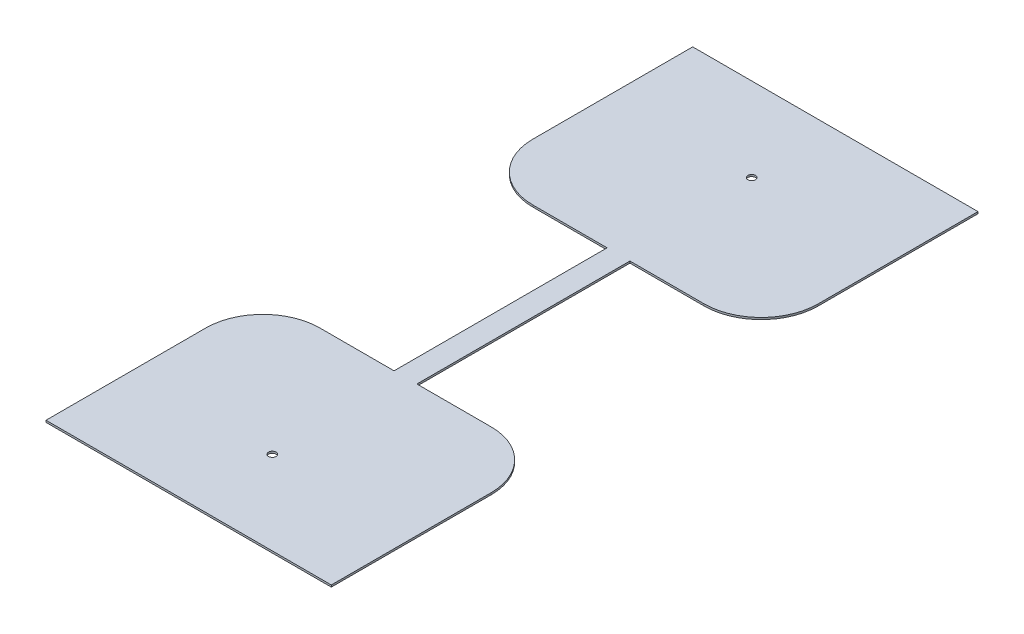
ISO-10303-21;
HEADER;
FILE_DESCRIPTION(('STEP AP214'),'2;1');
FILE_NAME('part.step','',(''),(''),'','','');
FILE_SCHEMA(('AUTOMOTIVE_DESIGN { 1 0 10303 214 1 1 1 1 }'));
ENDSEC;
DATA;
#1=APPLICATION_CONTEXT('core data for automotive mechanical design processes');
#2=APPLICATION_PROTOCOL_DEFINITION('international standard','automotive_design',2000,#1);
#3=PRODUCT_CONTEXT('',#1,'mechanical');
#4=PRODUCT('Part','Part','',(#3));
#5=PRODUCT_RELATED_PRODUCT_CATEGORY('part','',(#4));
#6=PRODUCT_DEFINITION_FORMATION('','',#4);
#7=PRODUCT_DEFINITION_CONTEXT('part definition',#1,'design');
#8=PRODUCT_DEFINITION('design','',#6,#7);
#9=PRODUCT_DEFINITION_SHAPE('','',#8);
#10=(LENGTH_UNIT() NAMED_UNIT(*) SI_UNIT(.MILLI.,.METRE.));
#11=(NAMED_UNIT(*) PLANE_ANGLE_UNIT() SI_UNIT($,.RADIAN.));
#12=(NAMED_UNIT(*) SI_UNIT($,.STERADIAN.) SOLID_ANGLE_UNIT());
#13=UNCERTAINTY_MEASURE_WITH_UNIT(LENGTH_MEASURE(1.E-05),#10,'distance_accuracy_value','');
#14=(GEOMETRIC_REPRESENTATION_CONTEXT(3) GLOBAL_UNCERTAINTY_ASSIGNED_CONTEXT((#13)) GLOBAL_UNIT_ASSIGNED_CONTEXT((#10,
#11,#12)) REPRESENTATION_CONTEXT('',''));
#15=CARTESIAN_POINT('',(0.,0.,0.));
#16=DIRECTION('',(0.,0.,1.));
#17=DIRECTION('',(1.,0.,0.));
#18=AXIS2_PLACEMENT_3D('',#15,#16,#17);
#19=CARTESIAN_POINT('',(-22.5,0.5,-43.));
#20=DIRECTION('',(0.,1.,0.));
#21=DIRECTION('',(0.,0.,1.));
#22=AXIS2_PLACEMENT_3D('',#19,#20,#21);
#23=PLANE('',#22);
#24=CARTESIAN_POINT('',(0.,0.5,63.));
#25=DIRECTION('',(0.,1.,0.));
#26=DIRECTION('',(0.,0.,-1.));
#27=AXIS2_PLACEMENT_3D('',#24,#25,#26);
#28=CIRCLE('',#27,1.);
#29=CARTESIAN_POINT('',(0.,0.5,62.));
#30=VERTEX_POINT('',#29);
#31=EDGE_CURVE('E182',#30,#30,#28,.T.);
#32=ORIENTED_EDGE('',*,*,#31,.F.);
#33=EDGE_LOOP('',(#32));
#34=FACE_BOUND('',#33,.T.);
#35=CARTESIAN_POINT('',(-22.5,0.5,-43.));
#36=DIRECTION('',(0.,1.,0.));
#37=DIRECTION('',(0.,0.,1.));
#38=AXIS2_PLACEMENT_3D('',#35,#36,#37);
#39=CIRCLE('',#38,15.);
#40=CARTESIAN_POINT('',(-37.5,0.5,-43.));
#41=VERTEX_POINT('',#40);
#42=CARTESIAN_POINT('',(-22.5,0.5,-28.));
#43=VERTEX_POINT('',#42);
#44=EDGE_CURVE('E209',#41,#43,#39,.T.);
#45=ORIENTED_EDGE('',*,*,#44,.T.);
#46=DIRECTION('',(1.,0.,0.));
#47=VECTOR('',#46,1.);
#48=CARTESIAN_POINT('',(-22.5,0.5,-28.));
#49=LINE('',#48,#47);
#50=CARTESIAN_POINT('',(-3.,0.5,-28.));
#51=VERTEX_POINT('',#50);
#52=EDGE_CURVE('E117',#43,#51,#49,.T.);
#53=ORIENTED_EDGE('',*,*,#52,.T.);
#54=DIRECTION('',(0.,0.,1.));
#55=VECTOR('',#54,1.);
#56=CARTESIAN_POINT('',(-3.,0.5,-28.));
#57=LINE('',#56,#55);
#58=CARTESIAN_POINT('',(-3.,0.5,28.));
#59=VERTEX_POINT('',#58);
#60=EDGE_CURVE('E248',#51,#59,#57,.T.);
#61=ORIENTED_EDGE('',*,*,#60,.T.);
#62=DIRECTION('',(-1.,0.,0.));
#63=VECTOR('',#62,1.);
#64=CARTESIAN_POINT('',(-22.5,0.5,28.));
#65=LINE('',#64,#63);
#66=CARTESIAN_POINT('',(-22.5,0.5,28.));
#67=VERTEX_POINT('',#66);
#68=EDGE_CURVE('E267',#59,#67,#65,.T.);
#69=ORIENTED_EDGE('',*,*,#68,.T.);
#70=CARTESIAN_POINT('',(-22.5,0.5,43.));
#71=DIRECTION('',(0.,1.,0.));
#72=DIRECTION('',(0.,0.,-1.));
#73=AXIS2_PLACEMENT_3D('',#70,#71,#72);
#74=CIRCLE('',#73,15.);
#75=CARTESIAN_POINT('',(-37.5,0.5,43.));
#76=VERTEX_POINT('',#75);
#77=EDGE_CURVE('E264',#67,#76,#74,.T.);
#78=ORIENTED_EDGE('',*,*,#77,.T.);
#79=DIRECTION('',(0.,0.,1.));
#80=VECTOR('',#79,1.);
#81=CARTESIAN_POINT('',(-37.5,0.5,85.));
#82=LINE('',#81,#80);
#83=CARTESIAN_POINT('',(-37.5,0.5,85.));
#84=VERTEX_POINT('',#83);
#85=EDGE_CURVE('E266',#76,#84,#82,.T.);
#86=ORIENTED_EDGE('',*,*,#85,.T.);
#87=DIRECTION('',(1.,0.,0.));
#88=VECTOR('',#87,1.);
#89=CARTESIAN_POINT('',(-37.5,0.5,85.));
#90=LINE('',#89,#88);
#91=CARTESIAN_POINT('',(37.5,0.5,85.));
#92=VERTEX_POINT('',#91);
#93=EDGE_CURVE('E269',#84,#92,#90,.T.);
#94=ORIENTED_EDGE('',*,*,#93,.T.);
#95=DIRECTION('',(0.,0.,-1.));
#96=VECTOR('',#95,1.);
#97=CARTESIAN_POINT('',(37.5,0.5,85.));
#98=LINE('',#97,#96);
#99=CARTESIAN_POINT('',(37.5,0.5,43.));
#100=VERTEX_POINT('',#99);
#101=EDGE_CURVE('E275',#92,#100,#98,.T.);
#102=ORIENTED_EDGE('',*,*,#101,.T.);
#103=CARTESIAN_POINT('',(22.5,0.5,43.));
#104=DIRECTION('',(0.,1.,0.));
#105=DIRECTION('',(0.,0.,1.));
#106=AXIS2_PLACEMENT_3D('',#103,#104,#105);
#107=CIRCLE('',#106,15.);
#108=CARTESIAN_POINT('',(22.5,0.5,28.));
#109=VERTEX_POINT('',#108);
#110=EDGE_CURVE('E277',#100,#109,#107,.T.);
#111=ORIENTED_EDGE('',*,*,#110,.T.);
#112=DIRECTION('',(-1.,0.,0.));
#113=VECTOR('',#112,1.);
#114=CARTESIAN_POINT('',(22.5,0.5,28.));
#115=LINE('',#114,#113);
#116=CARTESIAN_POINT('',(3.,0.5,28.));
#117=VERTEX_POINT('',#116);
#118=EDGE_CURVE('E279',#109,#117,#115,.T.);
#119=ORIENTED_EDGE('',*,*,#118,.T.);
#120=DIRECTION('',(0.,0.,-1.));
#121=VECTOR('',#120,1.);
#122=CARTESIAN_POINT('',(3.,0.5,-28.));
#123=LINE('',#122,#121);
#124=CARTESIAN_POINT('',(3.,0.5,-28.));
#125=VERTEX_POINT('',#124);
#126=EDGE_CURVE('E281',#117,#125,#123,.T.);
#127=ORIENTED_EDGE('',*,*,#126,.T.);
#128=DIRECTION('',(1.,0.,0.));
#129=VECTOR('',#128,1.);
#130=CARTESIAN_POINT('',(22.5,0.5,-28.));
#131=LINE('',#130,#129);
#132=CARTESIAN_POINT('',(22.5,0.5,-28.));
#133=VERTEX_POINT('',#132);
#134=EDGE_CURVE('E283',#125,#133,#131,.T.);
#135=ORIENTED_EDGE('',*,*,#134,.T.);
#136=CARTESIAN_POINT('',(22.5,0.5,-43.));
#137=DIRECTION('',(0.,1.,0.));
#138=DIRECTION('',(0.,0.,-1.));
#139=AXIS2_PLACEMENT_3D('',#136,#137,#138);
#140=CIRCLE('',#139,15.);
#141=CARTESIAN_POINT('',(37.5,0.5,-43.));
#142=VERTEX_POINT('',#141);
#143=EDGE_CURVE('E160',#133,#142,#140,.T.);
#144=ORIENTED_EDGE('',*,*,#143,.T.);
#145=DIRECTION('',(0.,0.,-1.));
#146=VECTOR('',#145,1.);
#147=CARTESIAN_POINT('',(37.5,0.5,-85.));
#148=LINE('',#147,#146);
#149=CARTESIAN_POINT('',(37.5,0.5,-85.));
#150=VERTEX_POINT('',#149);
#151=EDGE_CURVE('E154',#142,#150,#148,.T.);
#152=ORIENTED_EDGE('',*,*,#151,.T.);
#153=DIRECTION('',(-1.,0.,0.));
#154=VECTOR('',#153,1.);
#155=CARTESIAN_POINT('',(-37.5,0.5,-85.));
#156=LINE('',#155,#154);
#157=CARTESIAN_POINT('',(-37.5,0.5,-85.));
#158=VERTEX_POINT('',#157);
#159=EDGE_CURVE('E158',#150,#158,#156,.T.);
#160=ORIENTED_EDGE('',*,*,#159,.T.);
#161=DIRECTION('',(0.,0.,1.));
#162=VECTOR('',#161,1.);
#163=CARTESIAN_POINT('',(-37.5,0.5,-85.));
#164=LINE('',#163,#162);
#165=EDGE_CURVE('E50',#158,#41,#164,.T.);
#166=ORIENTED_EDGE('',*,*,#165,.T.);
#167=EDGE_LOOP('',(#45,#53,#61,#69,#78,#86,#94,#102,#111,#119,#127,#135,#144,#152,#160,#166));
#168=FACE_BOUND('',#167,.T.);
#169=CARTESIAN_POINT('',(0.,0.5,-63.));
#170=DIRECTION('',(0.,1.,0.));
#171=DIRECTION('',(0.,0.,1.));
#172=AXIS2_PLACEMENT_3D('',#169,#170,#171);
#173=CIRCLE('',#172,1.);
#174=CARTESIAN_POINT('',(0.,0.5,-62.));
#175=VERTEX_POINT('',#174);
#176=EDGE_CURVE('E325',#175,#175,#173,.T.);
#177=ORIENTED_EDGE('',*,*,#176,.F.);
#178=EDGE_LOOP('',(#177));
#179=FACE_BOUND('',#178,.T.);
#180=ADVANCED_FACE('F33',(#34,#168,#179),#23,.T.);
#181=CARTESIAN_POINT('',(-22.5,0.,-43.));
#182=DIRECTION('',(0.,1.,0.));
#183=DIRECTION('',(0.,0.,1.));
#184=AXIS2_PLACEMENT_3D('',#181,#182,#183);
#185=PLANE('',#184);
#186=CARTESIAN_POINT('',(-22.5,0.,-43.));
#187=DIRECTION('',(0.,1.,0.));
#188=DIRECTION('',(0.,0.,1.));
#189=AXIS2_PLACEMENT_3D('',#186,#187,#188);
#190=CIRCLE('',#189,15.);
#191=CARTESIAN_POINT('',(-37.5,0.,-43.));
#192=VERTEX_POINT('',#191);
#193=CARTESIAN_POINT('',(-22.5,0.,-28.));
#194=VERTEX_POINT('',#193);
#195=EDGE_CURVE('E178',#192,#194,#190,.T.);
#196=ORIENTED_EDGE('',*,*,#195,.F.);
#197=DIRECTION('',(0.,0.,1.));
#198=VECTOR('',#197,1.);
#199=CARTESIAN_POINT('',(-37.5,0.,-85.));
#200=LINE('',#199,#198);
#201=CARTESIAN_POINT('',(-37.5,0.,-85.));
#202=VERTEX_POINT('',#201);
#203=EDGE_CURVE('E109',#202,#192,#200,.T.);
#204=ORIENTED_EDGE('',*,*,#203,.F.);
#205=DIRECTION('',(-1.,0.,0.));
#206=VECTOR('',#205,1.);
#207=CARTESIAN_POINT('',(-37.5,0.,-85.));
#208=LINE('',#207,#206);
#209=CARTESIAN_POINT('',(37.5,0.,-85.));
#210=VERTEX_POINT('',#209);
#211=EDGE_CURVE('E103',#210,#202,#208,.T.);
#212=ORIENTED_EDGE('',*,*,#211,.F.);
#213=DIRECTION('',(0.,0.,-1.));
#214=VECTOR('',#213,1.);
#215=CARTESIAN_POINT('',(37.5,0.,-85.));
#216=LINE('',#215,#214);
#217=CARTESIAN_POINT('',(37.5,0.,-43.));
#218=VERTEX_POINT('',#217);
#219=EDGE_CURVE('E168',#218,#210,#216,.T.);
#220=ORIENTED_EDGE('',*,*,#219,.F.);
#221=CARTESIAN_POINT('',(22.5,0.,-43.));
#222=DIRECTION('',(0.,1.,0.));
#223=DIRECTION('',(0.,0.,-1.));
#224=AXIS2_PLACEMENT_3D('',#221,#222,#223);
#225=CIRCLE('',#224,15.);
#226=CARTESIAN_POINT('',(22.5,0.,-28.));
#227=VERTEX_POINT('',#226);
#228=EDGE_CURVE('E204',#227,#218,#225,.T.);
#229=ORIENTED_EDGE('',*,*,#228,.F.);
#230=DIRECTION('',(1.,0.,0.));
#231=VECTOR('',#230,1.);
#232=CARTESIAN_POINT('',(22.5,0.,-28.));
#233=LINE('',#232,#231);
#234=CARTESIAN_POINT('',(3.,0.,-28.));
#235=VERTEX_POINT('',#234);
#236=EDGE_CURVE('E202',#235,#227,#233,.T.);
#237=ORIENTED_EDGE('',*,*,#236,.F.);
#238=DIRECTION('',(0.,0.,-1.));
#239=VECTOR('',#238,1.);
#240=CARTESIAN_POINT('',(3.,0.,-28.));
#241=LINE('',#240,#239);
#242=CARTESIAN_POINT('',(3.,0.,28.));
#243=VERTEX_POINT('',#242);
#244=EDGE_CURVE('E200',#243,#235,#241,.T.);
#245=ORIENTED_EDGE('',*,*,#244,.F.);
#246=DIRECTION('',(-1.,0.,0.));
#247=VECTOR('',#246,1.);
#248=CARTESIAN_POINT('',(22.5,0.,28.));
#249=LINE('',#248,#247);
#250=CARTESIAN_POINT('',(22.5,0.,28.));
#251=VERTEX_POINT('',#250);
#252=EDGE_CURVE('E198',#251,#243,#249,.T.);
#253=ORIENTED_EDGE('',*,*,#252,.F.);
#254=CARTESIAN_POINT('',(22.5,0.,43.));
#255=DIRECTION('',(0.,1.,0.));
#256=DIRECTION('',(0.,0.,1.));
#257=AXIS2_PLACEMENT_3D('',#254,#255,#256);
#258=CIRCLE('',#257,15.);
#259=CARTESIAN_POINT('',(37.5,0.,43.));
#260=VERTEX_POINT('',#259);
#261=EDGE_CURVE('E196',#260,#251,#258,.T.);
#262=ORIENTED_EDGE('',*,*,#261,.F.);
#263=DIRECTION('',(0.,0.,-1.));
#264=VECTOR('',#263,1.);
#265=CARTESIAN_POINT('',(37.5,0.,85.));
#266=LINE('',#265,#264);
#267=CARTESIAN_POINT('',(37.5,0.,85.));
#268=VERTEX_POINT('',#267);
#269=EDGE_CURVE('E194',#268,#260,#266,.T.);
#270=ORIENTED_EDGE('',*,*,#269,.F.);
#271=DIRECTION('',(1.,0.,0.));
#272=VECTOR('',#271,1.);
#273=CARTESIAN_POINT('',(-37.5,0.,85.));
#274=LINE('',#273,#272);
#275=CARTESIAN_POINT('',(-37.5,0.,85.));
#276=VERTEX_POINT('',#275);
#277=EDGE_CURVE('E192',#276,#268,#274,.T.);
#278=ORIENTED_EDGE('',*,*,#277,.F.);
#279=DIRECTION('',(0.,0.,1.));
#280=VECTOR('',#279,1.);
#281=CARTESIAN_POINT('',(-37.5,0.,85.));
#282=LINE('',#281,#280);
#283=CARTESIAN_POINT('',(-37.5,0.,43.));
#284=VERTEX_POINT('',#283);
#285=EDGE_CURVE('E190',#284,#276,#282,.T.);
#286=ORIENTED_EDGE('',*,*,#285,.F.);
#287=CARTESIAN_POINT('',(-22.5,0.,43.));
#288=DIRECTION('',(0.,1.,0.));
#289=DIRECTION('',(0.,0.,-1.));
#290=AXIS2_PLACEMENT_3D('',#287,#288,#289);
#291=CIRCLE('',#290,15.);
#292=CARTESIAN_POINT('',(-22.5,0.,28.));
#293=VERTEX_POINT('',#292);
#294=EDGE_CURVE('E188',#293,#284,#291,.T.);
#295=ORIENTED_EDGE('',*,*,#294,.F.);
#296=DIRECTION('',(-1.,0.,0.));
#297=VECTOR('',#296,1.);
#298=CARTESIAN_POINT('',(-22.5,0.,28.));
#299=LINE('',#298,#297);
#300=CARTESIAN_POINT('',(-3.,0.,28.));
#301=VERTEX_POINT('',#300);
#302=EDGE_CURVE('E186',#301,#293,#299,.T.);
#303=ORIENTED_EDGE('',*,*,#302,.F.);
#304=DIRECTION('',(0.,0.,1.));
#305=VECTOR('',#304,1.);
#306=CARTESIAN_POINT('',(-3.,0.,-28.));
#307=LINE('',#306,#305);
#308=CARTESIAN_POINT('',(-3.,0.,-28.));
#309=VERTEX_POINT('',#308);
#310=EDGE_CURVE('E184',#309,#301,#307,.T.);
#311=ORIENTED_EDGE('',*,*,#310,.F.);
#312=DIRECTION('',(1.,0.,0.));
#313=VECTOR('',#312,1.);
#314=CARTESIAN_POINT('',(-22.5,0.,-28.));
#315=LINE('',#314,#313);
#316=EDGE_CURVE('E181',#194,#309,#315,.T.);
#317=ORIENTED_EDGE('',*,*,#316,.F.);
#318=EDGE_LOOP('',(#196,#204,#212,#220,#229,#237,#245,#253,#262,#270,#278,#286,#295,#303,#311,#317));
#319=FACE_BOUND('',#318,.T.);
#320=CARTESIAN_POINT('',(0.,0.,63.));
#321=DIRECTION('',(0.,1.,0.));
#322=DIRECTION('',(0.,0.,-1.));
#323=AXIS2_PLACEMENT_3D('',#320,#321,#322);
#324=CIRCLE('',#323,1.);
#325=CARTESIAN_POINT('',(0.,0.,62.));
#326=VERTEX_POINT('',#325);
#327=EDGE_CURVE('E331',#326,#326,#324,.T.);
#328=ORIENTED_EDGE('',*,*,#327,.T.);
#329=EDGE_LOOP('',(#328));
#330=FACE_BOUND('',#329,.T.);
#331=CARTESIAN_POINT('',(0.,0.,-63.));
#332=DIRECTION('',(0.,1.,0.));
#333=DIRECTION('',(0.,0.,1.));
#334=AXIS2_PLACEMENT_3D('',#331,#332,#333);
#335=CIRCLE('',#334,1.);
#336=CARTESIAN_POINT('',(0.,0.,-62.));
#337=VERTEX_POINT('',#336);
#338=EDGE_CURVE('E328',#337,#337,#335,.T.);
#339=ORIENTED_EDGE('',*,*,#338,.T.);
#340=EDGE_LOOP('',(#339));
#341=FACE_BOUND('',#340,.T.);
#342=ADVANCED_FACE('F252',(#319,#330,#341),#185,.F.);
#343=CARTESIAN_POINT('',(-22.5,0.5,-43.));
#344=DIRECTION('',(0.,-1.,0.));
#345=DIRECTION('',(0.,0.,-1.));
#346=AXIS2_PLACEMENT_3D('',#343,#344,#345);
#347=CYLINDRICAL_SURFACE('',#346,15.);
#348=ORIENTED_EDGE('',*,*,#195,.T.);
#349=DIRECTION('',(0.,-1.,0.));
#350=VECTOR('',#349,1.);
#351=CARTESIAN_POINT('',(-22.5,0.5,-28.));
#352=LINE('',#351,#350);
#353=EDGE_CURVE('E11',#43,#194,#352,.T.);
#354=ORIENTED_EDGE('',*,*,#353,.F.);
#355=ORIENTED_EDGE('',*,*,#44,.F.);
#356=DIRECTION('',(0.,-1.,0.));
#357=VECTOR('',#356,1.);
#358=CARTESIAN_POINT('',(-37.5,0.5,-43.));
#359=LINE('',#358,#357);
#360=EDGE_CURVE('E174',#41,#192,#359,.T.);
#361=ORIENTED_EDGE('',*,*,#360,.T.);
#362=EDGE_LOOP('',(#348,#354,#355,#361));
#363=FACE_BOUND('',#362,.T.);
#364=ADVANCED_FACE('F35',(#363),#347,.T.);
#365=CARTESIAN_POINT('',(-22.5,0.5,-28.));
#366=DIRECTION('',(0.,0.,-1.));
#367=DIRECTION('',(-1.,0.,0.));
#368=AXIS2_PLACEMENT_3D('',#365,#366,#367);
#369=PLANE('',#368);
#370=ORIENTED_EDGE('',*,*,#316,.T.);
#371=DIRECTION('',(0.,-1.,0.));
#372=VECTOR('',#371,1.);
#373=CARTESIAN_POINT('',(-3.,0.5,-28.));
#374=LINE('',#373,#372);
#375=EDGE_CURVE('E42',#51,#309,#374,.T.);
#376=ORIENTED_EDGE('',*,*,#375,.F.);
#377=ORIENTED_EDGE('',*,*,#52,.F.);
#378=ORIENTED_EDGE('',*,*,#353,.T.);
#379=EDGE_LOOP('',(#370,#376,#377,#378));
#380=FACE_BOUND('',#379,.T.);
#381=ADVANCED_FACE('F464',(#380),#369,.F.);
#382=CARTESIAN_POINT('',(-3.,0.5,-28.));
#383=DIRECTION('',(1.,0.,0.));
#384=DIRECTION('',(0.,0.,-1.));
#385=AXIS2_PLACEMENT_3D('',#382,#383,#384);
#386=PLANE('',#385);
#387=ORIENTED_EDGE('',*,*,#310,.T.);
#388=DIRECTION('',(0.,-1.,0.));
#389=VECTOR('',#388,1.);
#390=CARTESIAN_POINT('',(-3.,0.5,28.));
#391=LINE('',#390,#389);
#392=EDGE_CURVE('E240',#59,#301,#391,.T.);
#393=ORIENTED_EDGE('',*,*,#392,.F.);
#394=ORIENTED_EDGE('',*,*,#60,.F.);
#395=ORIENTED_EDGE('',*,*,#375,.T.);
#396=EDGE_LOOP('',(#387,#393,#394,#395));
#397=FACE_BOUND('',#396,.T.);
#398=ADVANCED_FACE('F246',(#397),#386,.F.);
#399=CARTESIAN_POINT('',(-22.5,0.5,28.));
#400=DIRECTION('',(0.,0.,1.));
#401=DIRECTION('',(1.,0.,0.));
#402=AXIS2_PLACEMENT_3D('',#399,#400,#401);
#403=PLANE('',#402);
#404=ORIENTED_EDGE('',*,*,#302,.T.);
#405=DIRECTION('',(0.,-1.,0.));
#406=VECTOR('',#405,1.);
#407=CARTESIAN_POINT('',(-22.5,0.5,28.));
#408=LINE('',#407,#406);
#409=EDGE_CURVE('E237',#67,#293,#408,.T.);
#410=ORIENTED_EDGE('',*,*,#409,.F.);
#411=ORIENTED_EDGE('',*,*,#68,.F.);
#412=ORIENTED_EDGE('',*,*,#392,.T.);
#413=EDGE_LOOP('',(#404,#410,#411,#412));
#414=FACE_BOUND('',#413,.T.);
#415=ADVANCED_FACE('F258',(#414),#403,.F.);
#416=CARTESIAN_POINT('',(-22.5,0.5,43.));
#417=DIRECTION('',(0.,-1.,0.));
#418=DIRECTION('',(0.,0.,-1.));
#419=AXIS2_PLACEMENT_3D('',#416,#417,#418);
#420=CYLINDRICAL_SURFACE('',#419,15.);
#421=ORIENTED_EDGE('',*,*,#294,.T.);
#422=DIRECTION('',(0.,-1.,0.));
#423=VECTOR('',#422,1.);
#424=CARTESIAN_POINT('',(-37.5,0.5,43.));
#425=LINE('',#424,#423);
#426=EDGE_CURVE('E234',#76,#284,#425,.T.);
#427=ORIENTED_EDGE('',*,*,#426,.F.);
#428=ORIENTED_EDGE('',*,*,#77,.F.);
#429=ORIENTED_EDGE('',*,*,#409,.T.);
#430=EDGE_LOOP('',(#421,#427,#428,#429));
#431=FACE_BOUND('',#430,.T.);
#432=ADVANCED_FACE('F262',(#431),#420,.T.);
#433=CARTESIAN_POINT('',(-37.5,0.5,85.));
#434=DIRECTION('',(1.,0.,0.));
#435=DIRECTION('',(0.,0.,-1.));
#436=AXIS2_PLACEMENT_3D('',#433,#434,#435);
#437=PLANE('',#436);
#438=ORIENTED_EDGE('',*,*,#285,.T.);
#439=DIRECTION('',(0.,-1.,0.));
#440=VECTOR('',#439,1.);
#441=CARTESIAN_POINT('',(-37.5,0.5,85.));
#442=LINE('',#441,#440);
#443=EDGE_CURVE('E231',#84,#276,#442,.T.);
#444=ORIENTED_EDGE('',*,*,#443,.F.);
#445=ORIENTED_EDGE('',*,*,#85,.F.);
#446=ORIENTED_EDGE('',*,*,#426,.T.);
#447=EDGE_LOOP('',(#438,#444,#445,#446));
#448=FACE_BOUND('',#447,.T.);
#449=ADVANCED_FACE('F429',(#448),#437,.F.);
#450=CARTESIAN_POINT('',(-37.5,0.5,85.));
#451=DIRECTION('',(0.,0.,-1.));
#452=DIRECTION('',(-1.,0.,0.));
#453=AXIS2_PLACEMENT_3D('',#450,#451,#452);
#454=PLANE('',#453);
#455=ORIENTED_EDGE('',*,*,#277,.T.);
#456=DIRECTION('',(0.,-1.,0.));
#457=VECTOR('',#456,1.);
#458=CARTESIAN_POINT('',(37.5,0.5,85.));
#459=LINE('',#458,#457);
#460=EDGE_CURVE('E228',#92,#268,#459,.T.);
#461=ORIENTED_EDGE('',*,*,#460,.F.);
#462=ORIENTED_EDGE('',*,*,#93,.F.);
#463=ORIENTED_EDGE('',*,*,#443,.T.);
#464=EDGE_LOOP('',(#455,#461,#462,#463));
#465=FACE_BOUND('',#464,.T.);
#466=ADVANCED_FACE('F419',(#465),#454,.F.);
#467=CARTESIAN_POINT('',(37.5,0.5,85.));
#468=DIRECTION('',(-1.,0.,0.));
#469=DIRECTION('',(0.,0.,1.));
#470=AXIS2_PLACEMENT_3D('',#467,#468,#469);
#471=PLANE('',#470);
#472=ORIENTED_EDGE('',*,*,#269,.T.);
#473=DIRECTION('',(0.,-1.,0.));
#474=VECTOR('',#473,1.);
#475=CARTESIAN_POINT('',(37.5,0.5,43.));
#476=LINE('',#475,#474);
#477=EDGE_CURVE('E225',#100,#260,#476,.T.);
#478=ORIENTED_EDGE('',*,*,#477,.F.);
#479=ORIENTED_EDGE('',*,*,#101,.F.);
#480=ORIENTED_EDGE('',*,*,#460,.T.);
#481=EDGE_LOOP('',(#472,#478,#479,#480));
#482=FACE_BOUND('',#481,.T.);
#483=ADVANCED_FACE('F409',(#482),#471,.F.);
#484=CARTESIAN_POINT('',(22.5,0.5,43.));
#485=DIRECTION('',(0.,-1.,0.));
#486=DIRECTION('',(0.,0.,-1.));
#487=AXIS2_PLACEMENT_3D('',#484,#485,#486);
#488=CYLINDRICAL_SURFACE('',#487,15.);
#489=ORIENTED_EDGE('',*,*,#261,.T.);
#490=DIRECTION('',(0.,-1.,0.));
#491=VECTOR('',#490,1.);
#492=CARTESIAN_POINT('',(22.5,0.5,28.));
#493=LINE('',#492,#491);
#494=EDGE_CURVE('E222',#109,#251,#493,.T.);
#495=ORIENTED_EDGE('',*,*,#494,.F.);
#496=ORIENTED_EDGE('',*,*,#110,.F.);
#497=ORIENTED_EDGE('',*,*,#477,.T.);
#498=EDGE_LOOP('',(#489,#495,#496,#497));
#499=FACE_BOUND('',#498,.T.);
#500=ADVANCED_FACE('F399',(#499),#488,.T.);
#501=CARTESIAN_POINT('',(22.5,0.5,28.));
#502=DIRECTION('',(0.,0.,1.));
#503=DIRECTION('',(1.,0.,0.));
#504=AXIS2_PLACEMENT_3D('',#501,#502,#503);
#505=PLANE('',#504);
#506=ORIENTED_EDGE('',*,*,#252,.T.);
#507=DIRECTION('',(0.,-1.,0.));
#508=VECTOR('',#507,1.);
#509=CARTESIAN_POINT('',(3.,0.5,28.));
#510=LINE('',#509,#508);
#511=EDGE_CURVE('E219',#117,#243,#510,.T.);
#512=ORIENTED_EDGE('',*,*,#511,.F.);
#513=ORIENTED_EDGE('',*,*,#118,.F.);
#514=ORIENTED_EDGE('',*,*,#494,.T.);
#515=EDGE_LOOP('',(#506,#512,#513,#514));
#516=FACE_BOUND('',#515,.T.);
#517=ADVANCED_FACE('F389',(#516),#505,.F.);
#518=CARTESIAN_POINT('',(3.,0.5,-28.));
#519=DIRECTION('',(-1.,0.,0.));
#520=DIRECTION('',(0.,0.,1.));
#521=AXIS2_PLACEMENT_3D('',#518,#519,#520);
#522=PLANE('',#521);
#523=ORIENTED_EDGE('',*,*,#244,.T.);
#524=DIRECTION('',(0.,-1.,0.));
#525=VECTOR('',#524,1.);
#526=CARTESIAN_POINT('',(3.,0.5,-28.));
#527=LINE('',#526,#525);
#528=EDGE_CURVE('E216',#125,#235,#527,.T.);
#529=ORIENTED_EDGE('',*,*,#528,.F.);
#530=ORIENTED_EDGE('',*,*,#126,.F.);
#531=ORIENTED_EDGE('',*,*,#511,.T.);
#532=EDGE_LOOP('',(#523,#529,#530,#531));
#533=FACE_BOUND('',#532,.T.);
#534=ADVANCED_FACE('F380',(#533),#522,.F.);
#535=CARTESIAN_POINT('',(22.5,0.5,-28.));
#536=DIRECTION('',(0.,0.,-1.));
#537=DIRECTION('',(-1.,0.,0.));
#538=AXIS2_PLACEMENT_3D('',#535,#536,#537);
#539=PLANE('',#538);
#540=ORIENTED_EDGE('',*,*,#236,.T.);
#541=DIRECTION('',(0.,-1.,0.));
#542=VECTOR('',#541,1.);
#543=CARTESIAN_POINT('',(22.5,0.5,-28.));
#544=LINE('',#543,#542);
#545=EDGE_CURVE('E213',#133,#227,#544,.T.);
#546=ORIENTED_EDGE('',*,*,#545,.F.);
#547=ORIENTED_EDGE('',*,*,#134,.F.);
#548=ORIENTED_EDGE('',*,*,#528,.T.);
#549=EDGE_LOOP('',(#540,#546,#547,#548));
#550=FACE_BOUND('',#549,.T.);
#551=ADVANCED_FACE('F289',(#550),#539,.F.);
#552=CARTESIAN_POINT('',(22.5,0.5,-43.));
#553=DIRECTION('',(0.,-1.,0.));
#554=DIRECTION('',(0.,0.,-1.));
#555=AXIS2_PLACEMENT_3D('',#552,#553,#554);
#556=CYLINDRICAL_SURFACE('',#555,15.);
#557=ORIENTED_EDGE('',*,*,#228,.T.);
#558=DIRECTION('',(0.,-1.,0.));
#559=VECTOR('',#558,1.);
#560=CARTESIAN_POINT('',(37.5,0.5,-43.));
#561=LINE('',#560,#559);
#562=EDGE_CURVE('E169',#142,#218,#561,.T.);
#563=ORIENTED_EDGE('',*,*,#562,.F.);
#564=ORIENTED_EDGE('',*,*,#143,.F.);
#565=ORIENTED_EDGE('',*,*,#545,.T.);
#566=EDGE_LOOP('',(#557,#563,#564,#565));
#567=FACE_BOUND('',#566,.T.);
#568=ADVANCED_FACE('F293',(#567),#556,.T.);
#569=CARTESIAN_POINT('',(37.5,0.5,-85.));
#570=DIRECTION('',(-1.,0.,0.));
#571=DIRECTION('',(0.,0.,1.));
#572=AXIS2_PLACEMENT_3D('',#569,#570,#571);
#573=PLANE('',#572);
#574=ORIENTED_EDGE('',*,*,#219,.T.);
#575=DIRECTION('',(0.,-1.,0.));
#576=VECTOR('',#575,1.);
#577=CARTESIAN_POINT('',(37.5,0.5,-85.));
#578=LINE('',#577,#576);
#579=EDGE_CURVE('E165',#150,#210,#578,.T.);
#580=ORIENTED_EDGE('',*,*,#579,.F.);
#581=ORIENTED_EDGE('',*,*,#151,.F.);
#582=ORIENTED_EDGE('',*,*,#562,.T.);
#583=EDGE_LOOP('',(#574,#580,#581,#582));
#584=FACE_BOUND('',#583,.T.);
#585=ADVANCED_FACE('F166',(#584),#573,.F.);
#586=CARTESIAN_POINT('',(-37.5,0.5,-85.));
#587=DIRECTION('',(0.,0.,1.));
#588=DIRECTION('',(1.,0.,0.));
#589=AXIS2_PLACEMENT_3D('',#586,#587,#588);
#590=PLANE('',#589);
#591=ORIENTED_EDGE('',*,*,#211,.T.);
#592=DIRECTION('',(0.,-1.,0.));
#593=VECTOR('',#592,1.);
#594=CARTESIAN_POINT('',(-37.5,0.5,-85.));
#595=LINE('',#594,#593);
#596=EDGE_CURVE('E170',#158,#202,#595,.T.);
#597=ORIENTED_EDGE('',*,*,#596,.F.);
#598=ORIENTED_EDGE('',*,*,#159,.F.);
#599=ORIENTED_EDGE('',*,*,#579,.T.);
#600=EDGE_LOOP('',(#591,#597,#598,#599));
#601=FACE_BOUND('',#600,.T.);
#602=ADVANCED_FACE('F172',(#601),#590,.F.);
#603=CARTESIAN_POINT('',(-37.5,0.5,-85.));
#604=DIRECTION('',(1.,0.,0.));
#605=DIRECTION('',(0.,0.,-1.));
#606=AXIS2_PLACEMENT_3D('',#603,#604,#605);
#607=PLANE('',#606);
#608=ORIENTED_EDGE('',*,*,#203,.T.);
#609=ORIENTED_EDGE('',*,*,#360,.F.);
#610=ORIENTED_EDGE('',*,*,#165,.F.);
#611=ORIENTED_EDGE('',*,*,#596,.T.);
#612=EDGE_LOOP('',(#608,#609,#610,#611));
#613=FACE_BOUND('',#612,.T.);
#614=ADVANCED_FACE('F297',(#613),#607,.F.);
#615=CARTESIAN_POINT('',(0.,0.5,63.));
#616=DIRECTION('',(0.,-1.,0.));
#617=DIRECTION('',(0.,0.,-1.));
#618=AXIS2_PLACEMENT_3D('',#615,#616,#617);
#619=CYLINDRICAL_SURFACE('',#618,1.);
#620=ORIENTED_EDGE('',*,*,#31,.T.);
#621=EDGE_LOOP('',(#620));
#622=FACE_BOUND('',#621,.T.);
#623=ORIENTED_EDGE('',*,*,#327,.F.);
#624=EDGE_LOOP('',(#623));
#625=FACE_BOUND('',#624,.T.);
#626=ADVANCED_FACE('F299',(#622,#625),#619,.F.);
#627=CARTESIAN_POINT('',(0.,0.5,-63.));
#628=DIRECTION('',(0.,-1.,0.));
#629=DIRECTION('',(0.,0.,-1.));
#630=AXIS2_PLACEMENT_3D('',#627,#628,#629);
#631=CYLINDRICAL_SURFACE('',#630,1.);
#632=ORIENTED_EDGE('',*,*,#176,.T.);
#633=EDGE_LOOP('',(#632));
#634=FACE_BOUND('',#633,.T.);
#635=ORIENTED_EDGE('',*,*,#338,.F.);
#636=EDGE_LOOP('',(#635));
#637=FACE_BOUND('',#636,.T.);
#638=ADVANCED_FACE('F305',(#634,#637),#631,.F.);
#639=CLOSED_SHELL('',(#180,#342,#364,#381,#398,#415,#432,#449,#466,#483,#500,#517,#534,#551,
#568,#585,#602,#614,#626,#638));
#640=MANIFOLD_SOLID_BREP('B2',#639);
#641=ADVANCED_BREP_SHAPE_REPRESENTATION('',(#18,#640),#14);
#642=SHAPE_DEFINITION_REPRESENTATION(#9,#641);
ENDSEC;
END-ISO-10303-21;
